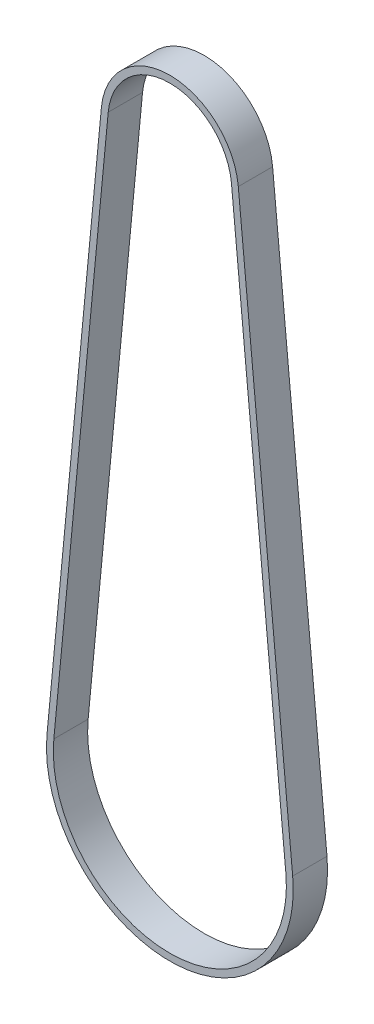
ISO-10303-21;
HEADER;
FILE_DESCRIPTION(('STEP AP214'),'2;1');
FILE_NAME('part.step','',(''),(''),'','','');
FILE_SCHEMA(('AUTOMOTIVE_DESIGN { 1 0 10303 214 1 1 1 1 }'));
ENDSEC;
DATA;
#1=APPLICATION_CONTEXT('core data for automotive mechanical design processes');
#2=APPLICATION_PROTOCOL_DEFINITION('international standard','automotive_design',2000,#1);
#3=PRODUCT_CONTEXT('',#1,'mechanical');
#4=PRODUCT('Part','Part','',(#3));
#5=PRODUCT_RELATED_PRODUCT_CATEGORY('part','',(#4));
#6=PRODUCT_DEFINITION_FORMATION('','',#4);
#7=PRODUCT_DEFINITION_CONTEXT('part definition',#1,'design');
#8=PRODUCT_DEFINITION('design','',#6,#7);
#9=PRODUCT_DEFINITION_SHAPE('','',#8);
#10=(LENGTH_UNIT() NAMED_UNIT(*) SI_UNIT(.MILLI.,.METRE.));
#11=(NAMED_UNIT(*) PLANE_ANGLE_UNIT() SI_UNIT($,.RADIAN.));
#12=(NAMED_UNIT(*) SI_UNIT($,.STERADIAN.) SOLID_ANGLE_UNIT());
#13=UNCERTAINTY_MEASURE_WITH_UNIT(LENGTH_MEASURE(1.E-05),#10,'distance_accuracy_value','');
#14=(GEOMETRIC_REPRESENTATION_CONTEXT(3) GLOBAL_UNCERTAINTY_ASSIGNED_CONTEXT((#13)) GLOBAL_UNIT_ASSIGNED_CONTEXT((#10,
#11,#12)) REPRESENTATION_CONTEXT('',''));
#15=CARTESIAN_POINT('',(0.,0.,0.));
#16=DIRECTION('',(0.,0.,1.));
#17=DIRECTION('',(1.,0.,0.));
#18=AXIS2_PLACEMENT_3D('',#15,#16,#17);
#19=CARTESIAN_POINT('',(0.,251.37,-15.));
#20=DIRECTION('',(0.,0.,1.));
#21=DIRECTION('',(1.,0.,0.));
#22=AXIS2_PLACEMENT_3D('',#19,#20,#21);
#23=CYLINDRICAL_SURFACE('',#22,30.055);
#24=CARTESIAN_POINT('',(0.,251.37,0.));
#25=DIRECTION('',(0.,0.,1.));
#26=DIRECTION('',(1.,0.,0.));
#27=AXIS2_PLACEMENT_3D('',#24,#25,#26);
#28=CIRCLE('',#27,30.055);
#29=CARTESIAN_POINT('',(29.919128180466,254.224609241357,0.));
#30=VERTEX_POINT('',#29);
#31=CARTESIAN_POINT('',(-29.9191281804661,254.224609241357,0.));
#32=VERTEX_POINT('',#31);
#33=EDGE_CURVE('E132',#30,#32,#28,.T.);
#34=ORIENTED_EDGE('',*,*,#33,.F.);
#35=DIRECTION('',(0.,0.,1.));
#36=VECTOR('',#35,1.);
#37=CARTESIAN_POINT('',(29.919128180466,254.224609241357,-15.));
#38=LINE('',#37,#36);
#39=CARTESIAN_POINT('',(29.919128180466,254.224609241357,-15.));
#40=VERTEX_POINT('',#39);
#41=EDGE_CURVE('E11',#40,#30,#38,.T.);
#42=ORIENTED_EDGE('',*,*,#41,.F.);
#43=CARTESIAN_POINT('',(0.,251.37,-15.));
#44=DIRECTION('',(0.,0.,1.));
#45=DIRECTION('',(1.,0.,0.));
#46=AXIS2_PLACEMENT_3D('',#43,#44,#45);
#47=CIRCLE('',#46,30.055);
#48=CARTESIAN_POINT('',(-29.9191281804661,254.224609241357,-15.));
#49=VERTEX_POINT('',#48);
#50=EDGE_CURVE('E146',#40,#49,#47,.T.);
#51=ORIENTED_EDGE('',*,*,#50,.T.);
#52=DIRECTION('',(0.,0.,1.));
#53=VECTOR('',#52,1.);
#54=CARTESIAN_POINT('',(-29.9191281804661,254.224609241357,-15.));
#55=LINE('',#54,#53);
#56=EDGE_CURVE('E36',#49,#32,#55,.T.);
#57=ORIENTED_EDGE('',*,*,#56,.T.);
#58=EDGE_LOOP('',(#34,#42,#51,#57));
#59=FACE_BOUND('',#58,.T.);
#60=ADVANCED_FACE('F33',(#59),#23,.T.);
#61=CARTESIAN_POINT('',(29.919128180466,254.224609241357,-15.));
#62=DIRECTION('',(0.99547922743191,0.0949795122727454,0.));
#63=DIRECTION('',(-0.0949795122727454,0.99547922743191,0.));
#64=AXIS2_PLACEMENT_3D('',#61,#62,#63);
#65=PLANE('',#64);
#66=DIRECTION('',(-0.0949795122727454,0.99547922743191,0.));
#67=VECTOR('',#66,1.);
#68=CARTESIAN_POINT('',(29.919128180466,254.224609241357,0.));
#69=LINE('',#68,#67);
#70=CARTESIAN_POINT('',(53.6861947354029,5.12224509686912,0.));
#71=VERTEX_POINT('',#70);
#72=EDGE_CURVE('E143',#71,#30,#69,.T.);
#73=ORIENTED_EDGE('',*,*,#72,.F.);
#74=DIRECTION('',(0.,0.,1.));
#75=VECTOR('',#74,1.);
#76=CARTESIAN_POINT('',(53.6861947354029,5.12224509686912,-15.));
#77=LINE('',#76,#75);
#78=CARTESIAN_POINT('',(53.6861947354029,5.12224509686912,-15.));
#79=VERTEX_POINT('',#78);
#80=EDGE_CURVE('E41',#79,#71,#77,.T.);
#81=ORIENTED_EDGE('',*,*,#80,.F.);
#82=DIRECTION('',(-0.0949795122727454,0.99547922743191,0.));
#83=VECTOR('',#82,1.);
#84=CARTESIAN_POINT('',(29.919128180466,254.224609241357,-15.));
#85=LINE('',#84,#83);
#86=EDGE_CURVE('E155',#79,#40,#85,.T.);
#87=ORIENTED_EDGE('',*,*,#86,.T.);
#88=ORIENTED_EDGE('',*,*,#41,.T.);
#89=EDGE_LOOP('',(#73,#81,#87,#88));
#90=FACE_BOUND('',#89,.T.);
#91=ADVANCED_FACE('F169',(#90),#65,.T.);
#92=CARTESIAN_POINT('',(0.,0.,-15.));
#93=DIRECTION('',(0.,0.,1.));
#94=DIRECTION('',(1.,0.,0.));
#95=AXIS2_PLACEMENT_3D('',#92,#93,#94);
#96=CYLINDRICAL_SURFACE('',#95,53.93);
#97=CARTESIAN_POINT('',(0.,0.,0.));
#98=DIRECTION('',(0.,0.,1.));
#99=DIRECTION('',(1.,0.,0.));
#100=AXIS2_PLACEMENT_3D('',#97,#98,#99);
#101=CIRCLE('',#100,53.93);
#102=CARTESIAN_POINT('',(-53.6861947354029,5.12224509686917,0.));
#103=VERTEX_POINT('',#102);
#104=EDGE_CURVE('E140',#103,#71,#101,.T.);
#105=ORIENTED_EDGE('',*,*,#104,.F.);
#106=DIRECTION('',(0.,0.,1.));
#107=VECTOR('',#106,1.);
#108=CARTESIAN_POINT('',(-53.6861947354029,5.12224509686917,-15.));
#109=LINE('',#108,#107);
#110=CARTESIAN_POINT('',(-53.6861947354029,5.12224509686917,-15.));
#111=VERTEX_POINT('',#110);
#112=EDGE_CURVE('E158',#111,#103,#109,.T.);
#113=ORIENTED_EDGE('',*,*,#112,.F.);
#114=CARTESIAN_POINT('',(0.,0.,-15.));
#115=DIRECTION('',(0.,0.,1.));
#116=DIRECTION('',(1.,0.,0.));
#117=AXIS2_PLACEMENT_3D('',#114,#115,#116);
#118=CIRCLE('',#117,53.93);
#119=EDGE_CURVE('E152',#111,#79,#118,.T.);
#120=ORIENTED_EDGE('',*,*,#119,.T.);
#121=ORIENTED_EDGE('',*,*,#80,.T.);
#122=EDGE_LOOP('',(#105,#113,#120,#121));
#123=FACE_BOUND('',#122,.T.);
#124=ADVANCED_FACE('F175',(#123),#96,.T.);
#125=CARTESIAN_POINT('',(-29.9191281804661,254.224609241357,-15.));
#126=DIRECTION('',(-0.99547922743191,0.0949795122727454,0.));
#127=DIRECTION('',(-0.0949795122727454,-0.99547922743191,0.));
#128=AXIS2_PLACEMENT_3D('',#125,#126,#127);
#129=PLANE('',#128);
#130=DIRECTION('',(-0.0949795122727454,-0.99547922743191,0.));
#131=VECTOR('',#130,1.);
#132=CARTESIAN_POINT('',(-29.9191281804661,254.224609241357,0.));
#133=LINE('',#132,#131);
#134=EDGE_CURVE('E137',#32,#103,#133,.T.);
#135=ORIENTED_EDGE('',*,*,#134,.F.);
#136=ORIENTED_EDGE('',*,*,#56,.F.);
#137=DIRECTION('',(-0.0949795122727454,-0.99547922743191,0.));
#138=VECTOR('',#137,1.);
#139=CARTESIAN_POINT('',(-29.9191281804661,254.224609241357,-15.));
#140=LINE('',#139,#138);
#141=EDGE_CURVE('E149',#49,#111,#140,.T.);
#142=ORIENTED_EDGE('',*,*,#141,.T.);
#143=ORIENTED_EDGE('',*,*,#112,.T.);
#144=EDGE_LOOP('',(#135,#136,#142,#143));
#145=FACE_BOUND('',#144,.T.);
#146=ADVANCED_FACE('F166',(#145),#129,.T.);
#147=CARTESIAN_POINT('',(0.,251.37,-15.));
#148=DIRECTION('',(0.,0.,1.));
#149=DIRECTION('',(1.,0.,0.));
#150=AXIS2_PLACEMENT_3D('',#147,#148,#149);
#151=PLANE('',#150);
#152=DIRECTION('',(-0.0949795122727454,0.995479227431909,0.));
#153=VECTOR('',#152,1.);
#154=CARTESIAN_POINT('',(26.9326904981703,253.939670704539,-15.));
#155=LINE('',#154,#153);
#156=CARTESIAN_POINT('',(50.6997570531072,4.83730656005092,-15.));
#157=VERTEX_POINT('',#156);
#158=CARTESIAN_POINT('',(26.9326904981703,253.939670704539,-15.));
#159=VERTEX_POINT('',#158);
#160=EDGE_CURVE('E127',#157,#159,#155,.T.);
#161=ORIENTED_EDGE('',*,*,#160,.T.);
#162=CARTESIAN_POINT('',(0.,251.37,-15.));
#163=DIRECTION('',(0.,0.,1.));
#164=DIRECTION('',(1.,0.,0.));
#165=AXIS2_PLACEMENT_3D('',#162,#163,#164);
#166=CIRCLE('',#165,27.055);
#167=CARTESIAN_POINT('',(-26.9326904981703,253.939670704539,-15.));
#168=VERTEX_POINT('',#167);
#169=EDGE_CURVE('E118',#159,#168,#166,.T.);
#170=ORIENTED_EDGE('',*,*,#169,.T.);
#171=DIRECTION('',(-0.0949795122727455,-0.995479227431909,0.));
#172=VECTOR('',#171,1.);
#173=CARTESIAN_POINT('',(-26.9326904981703,253.939670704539,-15.));
#174=LINE('',#173,#172);
#175=CARTESIAN_POINT('',(-50.6997570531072,4.83730656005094,-15.));
#176=VERTEX_POINT('',#175);
#177=EDGE_CURVE('E124',#168,#176,#174,.T.);
#178=ORIENTED_EDGE('',*,*,#177,.T.);
#179=CARTESIAN_POINT('',(0.,0.,-15.));
#180=DIRECTION('',(0.,0.,1.));
#181=DIRECTION('',(1.,0.,0.));
#182=AXIS2_PLACEMENT_3D('',#179,#180,#181);
#183=CIRCLE('',#182,50.93);
#184=EDGE_CURVE('E49',#176,#157,#183,.T.);
#185=ORIENTED_EDGE('',*,*,#184,.T.);
#186=EDGE_LOOP('',(#161,#170,#178,#185));
#187=FACE_BOUND('',#186,.T.);
#188=ORIENTED_EDGE('',*,*,#50,.F.);
#189=ORIENTED_EDGE('',*,*,#86,.F.);
#190=ORIENTED_EDGE('',*,*,#119,.F.);
#191=ORIENTED_EDGE('',*,*,#141,.F.);
#192=EDGE_LOOP('',(#188,#189,#190,#191));
#193=FACE_BOUND('',#192,.T.);
#194=ADVANCED_FACE('F172',(#187,#193),#151,.F.);
#195=CARTESIAN_POINT('',(0.,251.37,0.));
#196=DIRECTION('',(0.,0.,1.));
#197=DIRECTION('',(1.,0.,0.));
#198=AXIS2_PLACEMENT_3D('',#195,#196,#197);
#199=PLANE('',#198);
#200=CARTESIAN_POINT('',(0.,251.37,0.));
#201=DIRECTION('',(0.,0.,1.));
#202=DIRECTION('',(1.,0.,0.));
#203=AXIS2_PLACEMENT_3D('',#200,#201,#202);
#204=CIRCLE('',#203,27.055);
#205=CARTESIAN_POINT('',(26.9326904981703,253.939670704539,0.));
#206=VERTEX_POINT('',#205);
#207=CARTESIAN_POINT('',(-26.9326904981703,253.939670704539,0.));
#208=VERTEX_POINT('',#207);
#209=EDGE_CURVE('E57',#206,#208,#204,.T.);
#210=ORIENTED_EDGE('',*,*,#209,.F.);
#211=DIRECTION('',(-0.0949795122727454,0.995479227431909,0.));
#212=VECTOR('',#211,1.);
#213=CARTESIAN_POINT('',(26.9326904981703,253.939670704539,0.));
#214=LINE('',#213,#212);
#215=CARTESIAN_POINT('',(50.6997570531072,4.83730656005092,0.));
#216=VERTEX_POINT('',#215);
#217=EDGE_CURVE('E116',#216,#206,#214,.T.);
#218=ORIENTED_EDGE('',*,*,#217,.F.);
#219=CARTESIAN_POINT('',(0.,0.,0.));
#220=DIRECTION('',(0.,0.,1.));
#221=DIRECTION('',(1.,0.,0.));
#222=AXIS2_PLACEMENT_3D('',#219,#220,#221);
#223=CIRCLE('',#222,50.93);
#224=CARTESIAN_POINT('',(-50.6997570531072,4.83730656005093,0.));
#225=VERTEX_POINT('',#224);
#226=EDGE_CURVE('E100',#225,#216,#223,.T.);
#227=ORIENTED_EDGE('',*,*,#226,.F.);
#228=DIRECTION('',(-0.0949795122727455,-0.995479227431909,0.));
#229=VECTOR('',#228,1.);
#230=CARTESIAN_POINT('',(-26.9326904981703,253.939670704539,0.));
#231=LINE('',#230,#229);
#232=EDGE_CURVE('E109',#208,#225,#231,.T.);
#233=ORIENTED_EDGE('',*,*,#232,.F.);
#234=EDGE_LOOP('',(#210,#218,#227,#233));
#235=FACE_BOUND('',#234,.T.);
#236=ORIENTED_EDGE('',*,*,#33,.T.);
#237=ORIENTED_EDGE('',*,*,#134,.T.);
#238=ORIENTED_EDGE('',*,*,#104,.T.);
#239=ORIENTED_EDGE('',*,*,#72,.T.);
#240=EDGE_LOOP('',(#236,#237,#238,#239));
#241=FACE_BOUND('',#240,.T.);
#242=ADVANCED_FACE('F113',(#235,#241),#199,.T.);
#243=CARTESIAN_POINT('',(0.,251.37,-15.));
#244=DIRECTION('',(0.,0.,1.));
#245=DIRECTION('',(1.,0.,0.));
#246=AXIS2_PLACEMENT_3D('',#243,#244,#245);
#247=CYLINDRICAL_SURFACE('',#246,27.055);
#248=ORIENTED_EDGE('',*,*,#209,.T.);
#249=DIRECTION('',(0.,0.,1.));
#250=VECTOR('',#249,1.);
#251=CARTESIAN_POINT('',(-26.9326904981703,253.939670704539,-15.));
#252=LINE('',#251,#250);
#253=EDGE_CURVE('E106',#168,#208,#252,.T.);
#254=ORIENTED_EDGE('',*,*,#253,.F.);
#255=ORIENTED_EDGE('',*,*,#169,.F.);
#256=DIRECTION('',(0.,0.,1.));
#257=VECTOR('',#256,1.);
#258=CARTESIAN_POINT('',(26.9326904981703,253.939670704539,-15.));
#259=LINE('',#258,#257);
#260=EDGE_CURVE('E130',#159,#206,#259,.T.);
#261=ORIENTED_EDGE('',*,*,#260,.T.);
#262=EDGE_LOOP('',(#248,#254,#255,#261));
#263=FACE_BOUND('',#262,.T.);
#264=ADVANCED_FACE('F218',(#263),#247,.F.);
#265=CARTESIAN_POINT('',(26.9326904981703,253.939670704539,-15.));
#266=DIRECTION('',(0.995479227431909,0.0949795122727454,0.));
#267=DIRECTION('',(-0.0949795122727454,0.99547922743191,0.));
#268=AXIS2_PLACEMENT_3D('',#265,#266,#267);
#269=PLANE('',#268);
#270=ORIENTED_EDGE('',*,*,#217,.T.);
#271=ORIENTED_EDGE('',*,*,#260,.F.);
#272=ORIENTED_EDGE('',*,*,#160,.F.);
#273=DIRECTION('',(0.,0.,1.));
#274=VECTOR('',#273,1.);
#275=CARTESIAN_POINT('',(50.6997570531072,4.83730656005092,-15.));
#276=LINE('',#275,#274);
#277=EDGE_CURVE('E105',#157,#216,#276,.T.);
#278=ORIENTED_EDGE('',*,*,#277,.T.);
#279=EDGE_LOOP('',(#270,#271,#272,#278));
#280=FACE_BOUND('',#279,.T.);
#281=ADVANCED_FACE('F227',(#280),#269,.F.);
#282=CARTESIAN_POINT('',(0.,0.,-15.));
#283=DIRECTION('',(0.,0.,1.));
#284=DIRECTION('',(1.,0.,0.));
#285=AXIS2_PLACEMENT_3D('',#282,#283,#284);
#286=CYLINDRICAL_SURFACE('',#285,50.93);
#287=ORIENTED_EDGE('',*,*,#226,.T.);
#288=ORIENTED_EDGE('',*,*,#277,.F.);
#289=ORIENTED_EDGE('',*,*,#184,.F.);
#290=DIRECTION('',(0.,0.,1.));
#291=VECTOR('',#290,1.);
#292=CARTESIAN_POINT('',(-50.6997570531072,4.83730656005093,-15.));
#293=LINE('',#292,#291);
#294=EDGE_CURVE('E96',#176,#225,#293,.T.);
#295=ORIENTED_EDGE('',*,*,#294,.T.);
#296=EDGE_LOOP('',(#287,#288,#289,#295));
#297=FACE_BOUND('',#296,.T.);
#298=ADVANCED_FACE('F98',(#297),#286,.F.);
#299=CARTESIAN_POINT('',(-26.9326904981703,253.939670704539,-15.));
#300=DIRECTION('',(-0.995479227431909,0.0949795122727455,0.));
#301=DIRECTION('',(-0.0949795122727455,-0.99547922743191,0.));
#302=AXIS2_PLACEMENT_3D('',#299,#300,#301);
#303=PLANE('',#302);
#304=ORIENTED_EDGE('',*,*,#232,.T.);
#305=ORIENTED_EDGE('',*,*,#294,.F.);
#306=ORIENTED_EDGE('',*,*,#177,.F.);
#307=ORIENTED_EDGE('',*,*,#253,.T.);
#308=EDGE_LOOP('',(#304,#305,#306,#307));
#309=FACE_BOUND('',#308,.T.);
#310=ADVANCED_FACE('F110',(#309),#303,.F.);
#311=CLOSED_SHELL('',(#60,#91,#124,#146,#194,#242,#264,#281,#298,#310));
#312=MANIFOLD_SOLID_BREP('B2',#311);
#313=ADVANCED_BREP_SHAPE_REPRESENTATION('',(#18,#312),#14);
#314=SHAPE_DEFINITION_REPRESENTATION(#9,#313);
ENDSEC;
END-ISO-10303-21;
